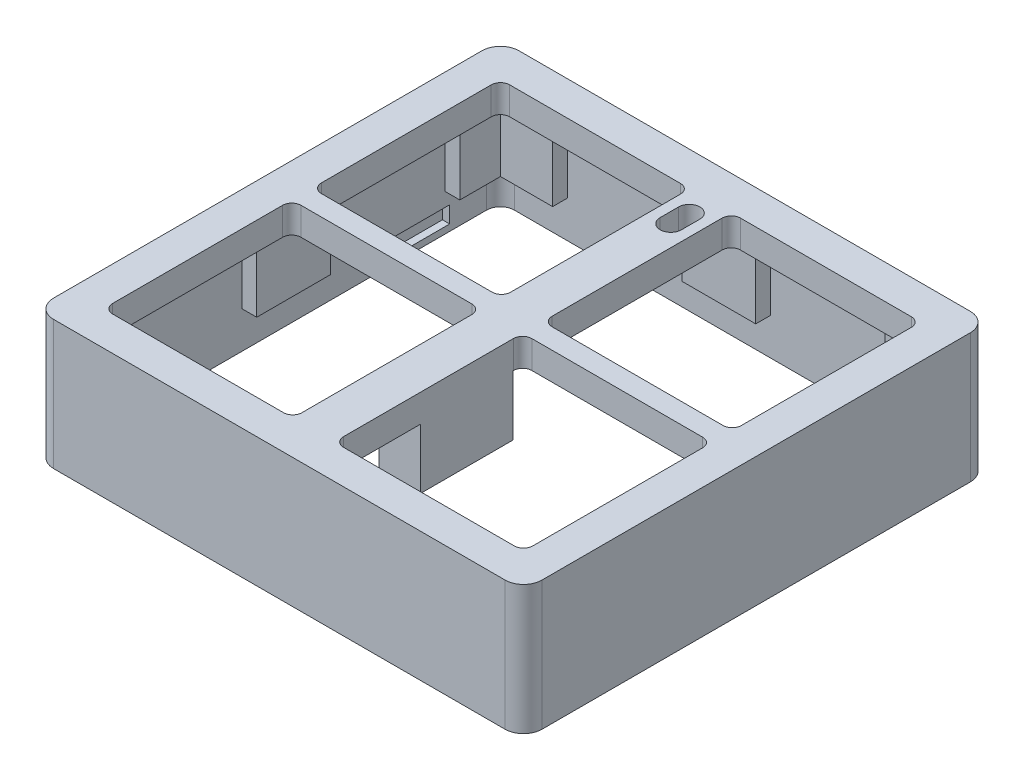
from build123d import *

# Parameters (mm, degrees)
SKETCH_1_W               = 52.9
SKETCH_1_H               = 50.4
SKETCH_1_W_2             = 50.5
SKETCH_1_H_2             = 48
EXTRUDE_1_DEPTH          = 14
SKETCH_2_W               = 50.5
SKETCH_2_H               = 48
SKETCH_2_W_2             = 47.3
SKETCH_2_H_2             = 44.8
EXTRUDE_2_DEPTH          = 10
FILLET_1_R               = 2
FILLET_2_R               = 1.5
SKETCH_3_W               = 20.5
SKETCH_3_H               = 20.4
EXTRUDE_3_DEPTH          = 3
CUT_EXTRUDE_1_DEPTH      = 40.123426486
SKETCH_5_W               = 4.5
SKETCH_5_H               = 10
SKETCH_5_R               = 1.15
EXTRUDE_4_DEPTH          = 6.5
CUT_EXTRUDE_2_DEPTH      = 26.03
CUT_EXTRUDE_2_DEPTH_BACK = 26.03
SKETCH_8_W               = 7
SKETCH_8_H               = 1.8
FILLET_3_R               = 1
SKETCH_9_W               = 2.5
SKETCH_9_H               = 14
SKETCH_9_W_2             = 14
SKETCH_9_H_2             = 1.6
CUT_EXTRUDE_3_DEPTH      = 7


with BuildPart() as part:
    # Sketch 1 → Extrude 1 (new body)
    with BuildSketch(Plane(origin=(0, 0, 0), x_dir=(1, 0, 0), z_dir=(0, 1, 0))):
        Rectangle(SKETCH_1_W, SKETCH_1_H)
        Rectangle(SKETCH_1_W_2, SKETCH_1_H_2, mode=Mode.SUBTRACT)
    extrude(amount=EXTRUDE_1_DEPTH)

    # Sketch 2 → Extrude 2 (add)
    with BuildSketch(Plane(origin=(0, 4, 0), x_dir=(-1, 0, 0), z_dir=(0, -1, 0))):
        Rectangle(SKETCH_2_W, SKETCH_2_H)
        Rectangle(SKETCH_2_W_2, SKETCH_2_H_2, mode=Mode.SUBTRACT)
    extrude(amount=-EXTRUDE_2_DEPTH)

    # Fillet 1
    fillet_1_edges = [part.edges().sort_by_distance(p)[0] for p in [
        (26.45, 7, 25.2),
        (-26.45, 7, 25.2),
        (-26.45, 7, -25.2),
        (26.45, 7, -25.2),
    ]]
    fillet(fillet_1_edges, radius=FILLET_1_R)

    # Fillet 2
    fillet_2_edges = [part.edges().sort_by_distance(p)[0] for p in [
        (25.25, 2, -24),
        (-25.25, 2, -24),
        (25.25, 2, 24),
        (-25.25, 2, 24),
    ]]
    fillet(fillet_2_edges, radius=FILLET_2_R)

    # Sketch 3 → Extrude 3 (add)
    with BuildSketch(Plane(origin=(0, 14, 0), x_dir=(1, 0, 0), z_dir=(0, 1, 0))):
        with BuildLine():
            Line((-24.45, -25.2), (24.45, -25.2))
            ThreePointArc((24.45, -25.2), (25.864213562, -24.614213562), (26.45, -23.2))
            Line((26.45, -23.2), (26.45, 23.2))
            ThreePointArc((26.45, 23.2), (25.864213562, 24.614213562), (24.45, 25.2))
            Line((24.45, 25.2), (-24.45, 25.2))
            ThreePointArc((-24.45, 25.2), (-25.864213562, 24.614213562), (-26.45, 23.2))
            Line((-26.45, 23.2), (-26.45, -23.2))
            ThreePointArc((-26.45, -23.2), (-25.864213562, -24.614213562), (-24.45, -25.2))
        make_face()
        with Locations((12.5, 11.3)):
            Rectangle(SKETCH_3_W, SKETCH_3_H, mode=Mode.SUBTRACT)
        with Locations((-12.5, -11.3)):
            Rectangle(SKETCH_3_W, SKETCH_3_H, mode=Mode.SUBTRACT)
        with Locations((-12.5, 11.3)):
            Rectangle(SKETCH_3_W, SKETCH_3_H, mode=Mode.SUBTRACT)
        with Locations((12.5, -11.3)):
            Rectangle(SKETCH_3_W, SKETCH_3_H, mode=Mode.SUBTRACT)
    extrude(amount=-EXTRUDE_3_DEPTH)

    # Sketch 4 → Cut-Extrude 1 (cut, through all)
    with BuildSketch(Plane(origin=(0, 14, 0), x_dir=(1, 0, 0), z_dir=(0, 1, 0))):
        with BuildLine():
            Line((1.15, 19.2), (1.15, 17.2))
            ThreePointArc((1.15, 17.2), (0, 16.05), (-1.15, 17.2))
            Line((-1.15, 17.2), (-1.15, 19.2))
            ThreePointArc((-1.15, 19.2), (0, 20.35), (1.15, 19.2))
        make_face()
    extrude(amount=-CUT_EXTRUDE_1_DEPTH, mode=Mode.SUBTRACT)

    # Sketch 5 → Extrude 4 (add)
    with BuildSketch(Plane(origin=(0, 11, 0), x_dir=(-1, 0, 0), z_dir=(0, -1, 0))):
        with Locations((0, -7.15)):
            Rectangle(SKETCH_5_W, SKETCH_5_H)
        with Locations(Location((0.497493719, -7.2, 0), (0, 0, 90))):
            Circle(SKETCH_5_R, mode=Mode.SUBTRACT)
    extrude(amount=EXTRUDE_4_DEPTH)

    # Sketch 8 → Cut-Extrude 2 (cut, two sides: drawn at the far end of the back side and taken through both)
    with BuildSketch(Plane(origin=(0, 0, 0), x_dir=(0, 0, -1), z_dir=(1, 0, 0)).offset(-CUT_EXTRUDE_2_DEPTH_BACK)):
        with Locations((-15, 1.6)):
            Rectangle(SKETCH_8_W, SKETCH_8_H)
        with Locations((15, 1.6)):
            Rectangle(SKETCH_8_W, SKETCH_8_H)
    extrude(amount=CUT_EXTRUDE_2_DEPTH + CUT_EXTRUDE_2_DEPTH_BACK, mode=Mode.SUBTRACT)

    # Fillet 3
    fillet_3_edges = [part.edges().sort_by_distance(p)[0] for p in [
        (-22.75, 12.5, -21.5),
        (-2.25, 12.5, -21.5),
        (-2.25, 12.5, -1.1),
        (-22.75, 12.5, -1.1),
        (22.75, 12.5, 21.5),
        (2.25, 12.5, 21.5),
        (2.25, 12.5, 1.1),
        (22.75, 12.5, 1.1),
        (22.75, 12.5, -21.5),
        (22.75, 12.5, -1.1),
        (2.25, 12.5, -1.1),
        (2.25, 12.5, -21.5),
        (-22.75, 12.5, 1.1),
        (-2.25, 12.5, 1.1),
        (-2.25, 12.5, 21.5),
        (-22.75, 12.5, 21.5),
    ]]
    fillet(fillet_3_edges, radius=FILLET_3_R)

    # Sketch 9 → Cut-Extrude 3 (cut)
    with BuildSketch(Plane(origin=(0, 11, 0), x_dir=(-1, 0, 0), z_dir=(0, -1, 0))):
        with Locations((24, -11)):
            Rectangle(SKETCH_9_W, SKETCH_9_H)
        with Locations((24, 11)):
            Rectangle(SKETCH_9_W, SKETCH_9_H)
        with Locations((-24, 11)):
            Rectangle(SKETCH_9_W, SKETCH_9_H)
        with Locations((-24, -11)):
            Rectangle(SKETCH_9_W, SKETCH_9_H)
        with Locations((11, -23.2)):
            Rectangle(SKETCH_9_W_2, SKETCH_9_H_2)
        with Locations((-11, -23.2)):
            Rectangle(SKETCH_9_W_2, SKETCH_9_H_2)
        with Locations((-11, 23.2)):
            Rectangle(SKETCH_9_W_2, SKETCH_9_H_2)
        with Locations((11, 23.2)):
            Rectangle(SKETCH_9_W_2, SKETCH_9_H_2)
    extrude(amount=CUT_EXTRUDE_3_DEPTH, mode=Mode.SUBTRACT)


solid = part.part
